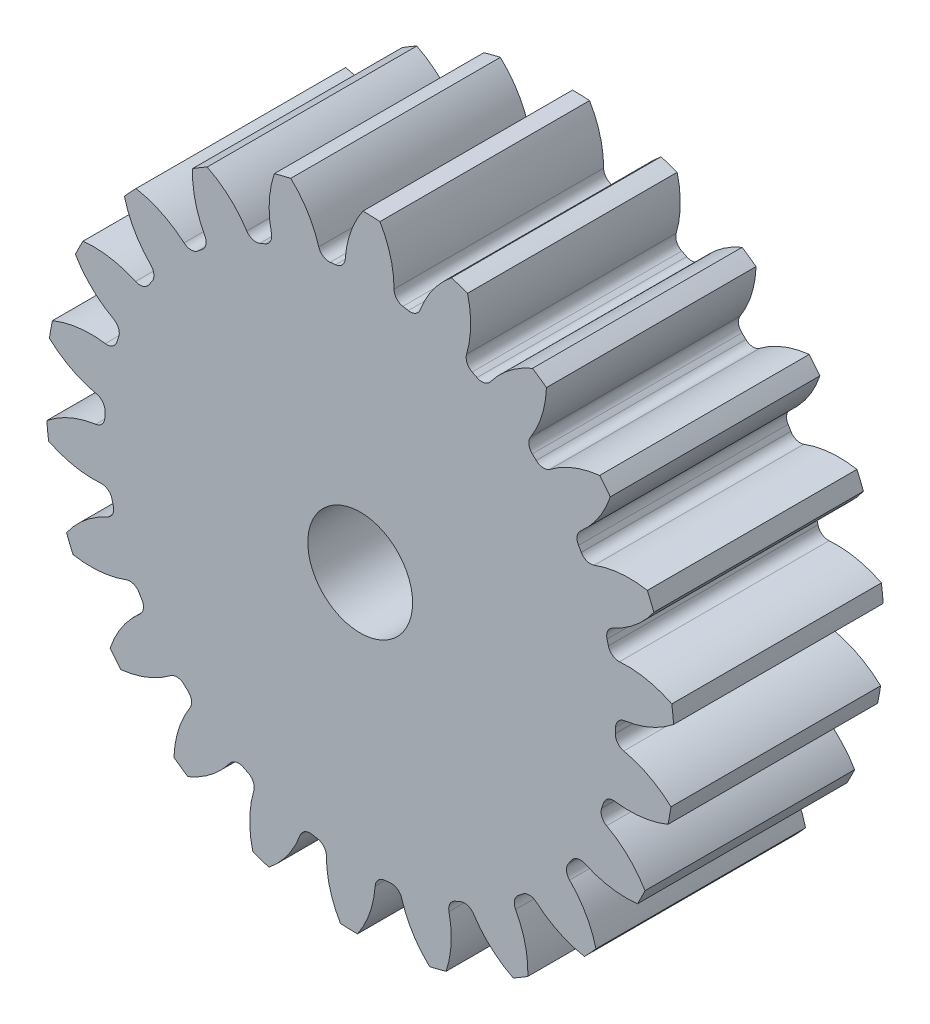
from build123d import *

# Parameters (mm, degrees)
SKETCH3_R         = 152.4
GEARBODY_DEPTH    = 101.6
TOOTHCUT_DEPTH    = 239.273120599
CIRPATTERN1_COUNT = 22
BOREDIA_R         = 25.4
BORE_DEPTH        = 12700


with BuildPart() as part:
    # Sketch3 → gearBody (new body)
    with BuildSketch(Plane.XY):
        Circle(SKETCH3_R)
    extrude(amount=GEARBODY_DEPTH)

    # Sketch2 → toothCut (cut, through all)
    with BuildSketch(Plane.XY):
        with BuildLine():
            ThreePointArc((123.6911483, -5.755906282), (123.745413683, -4.438830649), (123.785655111, -3.121251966))
            ThreePointArc((123.785655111, -3.121251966), (125.090119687, 0.183038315), (128.219165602, 1.865011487))
            ThreePointArc((128.219165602, 1.865011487), (141.046565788, 5.545360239), (152.4, 12.558682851))
            ThreePointArc((152.4, 12.558682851), (152.818295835, -5.481694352), (151.108497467, -23.445735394))
            ThreePointArc((151.108497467, -23.445735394), (140.286741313, -15.636973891), (127.756002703, -11.047011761))
            ThreePointArc((127.756002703, -11.047011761), (124.755510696, -9.145167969), (123.6911483, -5.755906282))
        make_face()
    toothcut = extrude(amount=TOOTHCUT_DEPTH, mode=Mode.SUBTRACT)

    # CirPattern1: toothCut ×22 about axis
    cirpattern1_axis = Axis((0, 0, 0), (0, 0, 1))
    for i in range(1, CIRPATTERN1_COUNT):
        add(toothcut.rotate(cirpattern1_axis, i * 360 / CIRPATTERN1_COUNT), mode=Mode.SUBTRACT)

    # boreDia → bore (cut, symmetric)
    with BuildSketch(Plane.XY):
        Circle(BOREDIA_R)
    extrude(amount=BORE_DEPTH, both=True, mode=Mode.SUBTRACT)


solid = part.part
